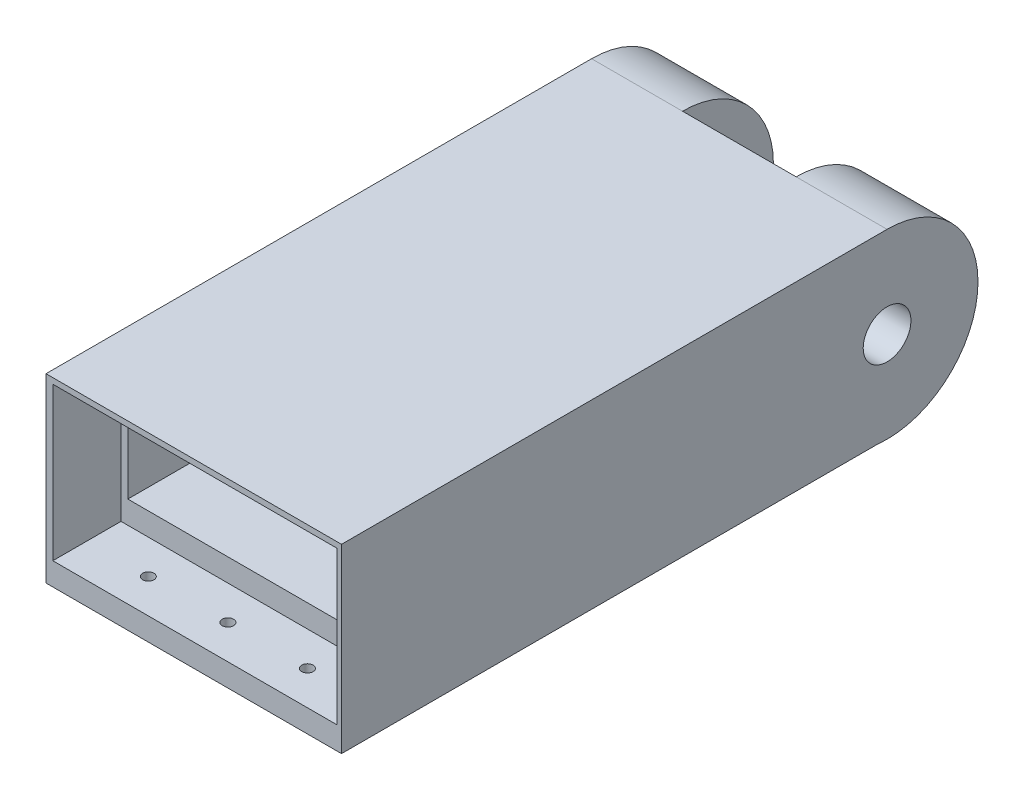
from build123d import *

# Parameters (mm, degrees)
EXTRUDE_1_DEPTH          = 40
EXTRUDE_2_DEPTH          = 50
EXTRUDE_START            = 40
EXTRUDE_3_DEPTH          = 40
CUT_EXTRUDE_START        = -6
CUT_EXTRUDE_1_DEPTH      = 118
CUT_EXTRUDE_2_REACH      = 1409.594
SKETCH_5_W               = 50
SKETCH_5_H               = 40
SKETCH_6_W               = 130
SKETCH_6_H               = 79.766678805
SKETCH_6_W_2             = 125.075330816
SKETCH_6_H_2             = 67.266678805
EXTRUDE_4_DEPTH          = 30
SKETCH_7_R               = 5.5
CUT_EXTRUDE_3_DEPTH      = 2.5
CUT_EXTRUDE_4_REACH      = 1439.299
SKETCH_8_R               = 2.5
CUT_EXTRUDE_5_DEPTH      = 1443.952254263
CUT_EXTRUDE_5_DEPTH_BACK = 1443.952254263
SKETCH_9_R               = 10.5


with BuildPart() as part:
    # Sketch 1 → Extrude 1 (new body)
    with BuildSketch(Plane(origin=(-32.302393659, 0, 0), x_dir=(0, 0, -1), z_dir=(1, 0, 0))):
        with BuildLine():
            Line((-1190, 142.51739572), (-1400, 142.51739572))
            Line((-1400, 142.51739572), (-1400, 62.750716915))
            Line((-1400, 62.750716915), (-1194.314076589, 62.750716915))
            ThreePointArc((-1194.314076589, 62.750716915), (-1150.058372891, 100.357205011), (-1190, 142.51739572))
        make_face()
    extrude(amount=EXTRUDE_1_DEPTH)

    # Sketch 2 → Extrude 2 (add)
    with BuildSketch(Plane.ZY.offset(32.302393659)):
        with BuildLine():
            Line((1194.314076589, 77.892433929), (1194.314076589, 62.750716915))
            Line((1194.314076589, 62.750716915), (1400, 62.750716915))
            Line((1400, 62.750716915), (1400, 142.51739572))
            Line((1400, 142.51739572), (1190, 142.51739572))
            Line((1190, 142.51739572), (1190, 127.51739572))
            ThreePointArc((1190, 127.51739572), (1214.906063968, 104.682569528), (1194.314076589, 77.892433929))
        make_face()
    extrude(amount=EXTRUDE_2_DEPTH)

    # Sketch 3 → Extrude 3 (add)
    with BuildSketch(Plane.ZY.offset(82.302393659).offset(EXTRUDE_START)):
        with BuildLine():
            Line((1190, 142.51739572), (1400, 142.51739572))
            Line((1400, 142.51739572), (1400, 62.750716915))
            Line((1400, 62.750716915), (1194.314076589, 62.750716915))
            ThreePointArc((1194.314076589, 62.750716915), (1150.058372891, 100.357205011), (1190, 142.51739572))
        make_face()
    extrude(amount=-EXTRUDE_3_DEPTH)

    # Sketch 4 → Cut-Extrude 1 (cut)
    with BuildSketch(Plane(origin=(7.697606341, 0, 0), x_dir=(0, 0, -1), z_dir=(1, 0, 0)).offset(CUT_EXTRUDE_START)):
        with BuildLine():
            Line((-1190, 137.51739572), (-1400, 137.51739572))
            Line((-1400, 137.51739572), (-1400, 82.750716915))
            Line((-1400, 82.750716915), (-1205.306155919, 82.750716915))
            ThreePointArc((-1205.306155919, 82.750716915), (-1213.655517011, 110.605443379), (-1190, 127.51739572))
            Line((-1190, 127.51739572), (-1190, 137.51739572))
        make_face()
    extrude(amount=-CUT_EXTRUDE_1_DEPTH, mode=Mode.SUBTRACT)

    # Sketch 5 → Cut-Extrude 2 (cut, up to next)
    with BuildSketch(Plane.XZ.offset(-62.750716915), mode=Mode.PRIVATE) as cut_extrude_2_sk1:
        with Locations((-57.302393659, 1214.314076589)):
            Rectangle(SKETCH_5_W, SKETCH_5_H)
    cut_extrude_2_tool1 = extrude(cut_extrude_2_sk1.sketch, amount=-CUT_EXTRUDE_2_REACH, mode=Mode.PRIVATE) & part.part
    add(cut_extrude_2_tool1.solids().sort_by_distance((-57.302394, 62.750717, 1214.314077))[0], mode=Mode.SUBTRACT)

    # Sketch 6 → Extrude 4 (add)
    with BuildSketch(Plane.XY.offset(1400)):
        with Locations((-57.302393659, 102.634056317)):
            Rectangle(SKETCH_6_W, SKETCH_6_H)
        with Locations((-56.764728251, 106.384056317)):
            Rectangle(SKETCH_6_W_2, SKETCH_6_H_2, mode=Mode.SUBTRACT)
    extrude(amount=EXTRUDE_4_DEPTH)

    # Sketch 7 → Cut-Extrude 3 (cut)
    with BuildSketch(Plane.XZ.offset(-62.750716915)):
        with Locations((-92.302393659, 1415)):
            Circle(SKETCH_7_R)
        with Locations((-57.302393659, 1415)):
            Circle(SKETCH_7_R)
        with Locations((-22.302393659, 1415)):
            Circle(SKETCH_7_R)
    extrude(amount=-CUT_EXTRUDE_3_DEPTH, mode=Mode.SUBTRACT)

    # Sketch 8 → Cut-Extrude 4 (cut, up to next)
    with BuildSketch(Plane.XZ.offset(-65.250716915), mode=Mode.PRIVATE) as cut_extrude_4_sk1:
        with Locations((-92.302393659, 1415)):
            Circle(SKETCH_8_R)
    cut_extrude_4_tool1 = extrude(cut_extrude_4_sk1.sketch, amount=-CUT_EXTRUDE_4_REACH, mode=Mode.PRIVATE) & part.part
    # Sketch 8 → Cut-Extrude 4 (cut, up to next)
    with BuildSketch(Plane.XZ.offset(-65.250716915), mode=Mode.PRIVATE) as cut_extrude_4_sk2:
        with Locations((-57.302393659, 1415)):
            Circle(SKETCH_8_R)
    cut_extrude_4_tool2 = extrude(cut_extrude_4_sk2.sketch, amount=-CUT_EXTRUDE_4_REACH, mode=Mode.PRIVATE) & part.part
    # Sketch 8 → Cut-Extrude 4 (cut, up to next)
    with BuildSketch(Plane.XZ.offset(-65.250716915), mode=Mode.PRIVATE) as cut_extrude_4_sk3:
        with Locations((-22.302393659, 1415)):
            Circle(SKETCH_8_R)
    cut_extrude_4_tool3 = extrude(cut_extrude_4_sk3.sketch, amount=-CUT_EXTRUDE_4_REACH, mode=Mode.PRIVATE) & part.part
    add(cut_extrude_4_tool1.solids().sort_by_distance((-92.302394, 65.250717, 1415))[0], mode=Mode.SUBTRACT)
    add(cut_extrude_4_tool2.solids().sort_by_distance((-57.302394, 65.250717, 1415))[0], mode=Mode.SUBTRACT)
    add(cut_extrude_4_tool3.solids().sort_by_distance((-22.302394, 65.250717, 1415))[0], mode=Mode.SUBTRACT)

    # Sketch 9 → Cut-Extrude 5 (cut, two sides: drawn at the far end of the back side and taken through both)
    with BuildSketch(Plane.ZY.offset(122.302393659).offset(-CUT_EXTRUDE_5_DEPTH_BACK)):
        with Locations((1190, 102.51739572)):
            Circle(SKETCH_9_R)
    extrude(amount=CUT_EXTRUDE_5_DEPTH + CUT_EXTRUDE_5_DEPTH_BACK, mode=Mode.SUBTRACT)


solid = part.part
